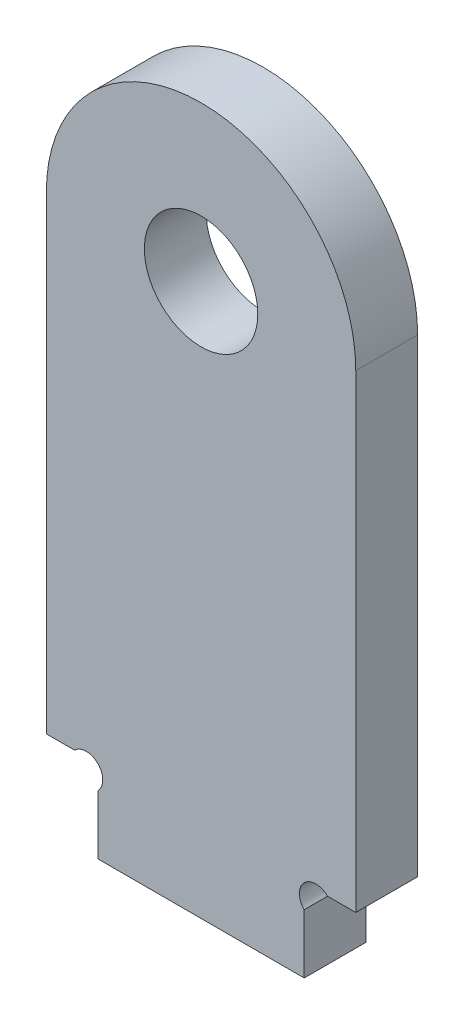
ISO-10303-21;
HEADER;
FILE_DESCRIPTION(('STEP AP214'),'2;1');
FILE_NAME('part.step','',(''),(''),'','','');
FILE_SCHEMA(('AUTOMOTIVE_DESIGN { 1 0 10303 214 1 1 1 1 }'));
ENDSEC;
DATA;
#1=APPLICATION_CONTEXT('core data for automotive mechanical design processes');
#2=APPLICATION_PROTOCOL_DEFINITION('international standard','automotive_design',2000,#1);
#3=PRODUCT_CONTEXT('',#1,'mechanical');
#4=PRODUCT('Part','Part','',(#3));
#5=PRODUCT_RELATED_PRODUCT_CATEGORY('part','',(#4));
#6=PRODUCT_DEFINITION_FORMATION('','',#4);
#7=PRODUCT_DEFINITION_CONTEXT('part definition',#1,'design');
#8=PRODUCT_DEFINITION('design','',#6,#7);
#9=PRODUCT_DEFINITION_SHAPE('','',#8);
#10=(LENGTH_UNIT() NAMED_UNIT(*) SI_UNIT(.MILLI.,.METRE.));
#11=(NAMED_UNIT(*) PLANE_ANGLE_UNIT() SI_UNIT($,.RADIAN.));
#12=(NAMED_UNIT(*) SI_UNIT($,.STERADIAN.) SOLID_ANGLE_UNIT());
#13=UNCERTAINTY_MEASURE_WITH_UNIT(LENGTH_MEASURE(1.E-05),#10,'distance_accuracy_value','');
#14=(GEOMETRIC_REPRESENTATION_CONTEXT(3) GLOBAL_UNCERTAINTY_ASSIGNED_CONTEXT((#13)) GLOBAL_UNIT_ASSIGNED_CONTEXT((#10,
#11,#12)) REPRESENTATION_CONTEXT('',''));
#15=CARTESIAN_POINT('',(0.,0.,0.));
#16=DIRECTION('',(0.,0.,1.));
#17=DIRECTION('',(1.,0.,0.));
#18=AXIS2_PLACEMENT_3D('',#15,#16,#17);
#19=CARTESIAN_POINT('',(15.,45.5,6.));
#20=DIRECTION('',(0.,0.,-1.));
#21=DIRECTION('',(-1.,0.,0.));
#22=AXIS2_PLACEMENT_3D('',#19,#20,#21);
#23=PLANE('',#22);
#24=CARTESIAN_POINT('',(15.,45.5,6.));
#25=DIRECTION('',(0.,0.,1.));
#26=DIRECTION('',(-1.,0.,0.));
#27=AXIS2_PLACEMENT_3D('',#24,#25,#26);
#28=CIRCLE('',#27,15.);
#29=CARTESIAN_POINT('',(30.,45.5,6.));
#30=VERTEX_POINT('',#29);
#31=CARTESIAN_POINT('',(0.,45.5,6.));
#32=VERTEX_POINT('',#31);
#33=EDGE_CURVE('E144',#30,#32,#28,.T.);
#34=ORIENTED_EDGE('',*,*,#33,.T.);
#35=DIRECTION('',(0.,-1.,0.));
#36=VECTOR('',#35,1.);
#37=CARTESIAN_POINT('',(0.,45.5,6.));
#38=LINE('',#37,#36);
#39=CARTESIAN_POINT('',(0.,0.,6.));
#40=VERTEX_POINT('',#39);
#41=EDGE_CURVE('E117',#32,#40,#38,.T.);
#42=ORIENTED_EDGE('',*,*,#41,.T.);
#43=DIRECTION('',(1.,0.,0.));
#44=VECTOR('',#43,1.);
#45=CARTESIAN_POINT('',(0.,0.,6.));
#46=LINE('',#45,#44);
#47=CARTESIAN_POINT('',(2.73725830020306,0.,6.));
#48=VERTEX_POINT('',#47);
#49=EDGE_CURVE('E147',#40,#48,#46,.T.);
#50=ORIENTED_EDGE('',*,*,#49,.T.);
#51=CARTESIAN_POINT('',(3.86862915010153,-1.13137084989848,6.));
#52=DIRECTION('',(0.,0.,-1.));
#53=DIRECTION('',(1.,0.,0.));
#54=AXIS2_PLACEMENT_3D('',#51,#52,#53);
#55=CIRCLE('',#54,1.6);
#56=CARTESIAN_POINT('',(5.,-2.26274169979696,6.));
#57=VERTEX_POINT('',#56);
#58=EDGE_CURVE('E149',#48,#57,#55,.T.);
#59=ORIENTED_EDGE('',*,*,#58,.T.);
#60=DIRECTION('',(0.,-1.,0.));
#61=VECTOR('',#60,1.);
#62=CARTESIAN_POINT('',(5.,-2.26274169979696,6.));
#63=LINE('',#62,#61);
#64=CARTESIAN_POINT('',(5.,-8.,6.));
#65=VERTEX_POINT('',#64);
#66=EDGE_CURVE('E151',#57,#65,#63,.T.);
#67=ORIENTED_EDGE('',*,*,#66,.T.);
#68=DIRECTION('',(1.,0.,0.));
#69=VECTOR('',#68,1.);
#70=CARTESIAN_POINT('',(5.,-8.,6.));
#71=LINE('',#70,#69);
#72=CARTESIAN_POINT('',(25.,-8.,6.));
#73=VERTEX_POINT('',#72);
#74=EDGE_CURVE('E153',#65,#73,#71,.T.);
#75=ORIENTED_EDGE('',*,*,#74,.T.);
#76=DIRECTION('',(0.,1.,0.));
#77=VECTOR('',#76,1.);
#78=CARTESIAN_POINT('',(25.,-8.,6.));
#79=LINE('',#78,#77);
#80=CARTESIAN_POINT('',(25.,-2.26274169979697,6.));
#81=VERTEX_POINT('',#80);
#82=EDGE_CURVE('E155',#73,#81,#79,.T.);
#83=ORIENTED_EDGE('',*,*,#82,.T.);
#84=CARTESIAN_POINT('',(26.1313708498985,-1.13137084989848,6.));
#85=DIRECTION('',(0.,0.,-1.));
#86=DIRECTION('',(-1.,0.,0.));
#87=AXIS2_PLACEMENT_3D('',#84,#85,#86);
#88=CIRCLE('',#87,1.6);
#89=CARTESIAN_POINT('',(27.262741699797,0.,6.));
#90=VERTEX_POINT('',#89);
#91=EDGE_CURVE('E157',#81,#90,#88,.T.);
#92=ORIENTED_EDGE('',*,*,#91,.T.);
#93=DIRECTION('',(1.,0.,0.));
#94=VECTOR('',#93,1.);
#95=CARTESIAN_POINT('',(27.262741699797,0.,6.));
#96=LINE('',#95,#94);
#97=CARTESIAN_POINT('',(30.,0.,6.));
#98=VERTEX_POINT('',#97);
#99=EDGE_CURVE('E46',#90,#98,#96,.T.);
#100=ORIENTED_EDGE('',*,*,#99,.T.);
#101=DIRECTION('',(0.,1.,0.));
#102=VECTOR('',#101,1.);
#103=CARTESIAN_POINT('',(30.,0.,6.));
#104=LINE('',#103,#102);
#105=EDGE_CURVE('E41',#98,#30,#104,.T.);
#106=ORIENTED_EDGE('',*,*,#105,.T.);
#107=EDGE_LOOP('',(#34,#42,#50,#59,#67,#75,#83,#92,#100,#106));
#108=FACE_BOUND('',#107,.T.);
#109=CARTESIAN_POINT('',(15.,45.5,6.));
#110=DIRECTION('',(0.,0.,1.));
#111=DIRECTION('',(1.,0.,0.));
#112=AXIS2_PLACEMENT_3D('',#109,#110,#111);
#113=CIRCLE('',#112,5.5);
#114=CARTESIAN_POINT('',(20.5,45.5,6.));
#115=VERTEX_POINT('',#114);
#116=EDGE_CURVE('E122',#115,#115,#113,.T.);
#117=ORIENTED_EDGE('',*,*,#116,.F.);
#118=EDGE_LOOP('',(#117));
#119=FACE_BOUND('',#118,.T.);
#120=ADVANCED_FACE('F26',(#108,#119),#23,.F.);
#121=CARTESIAN_POINT('',(15.,45.5,0.));
#122=DIRECTION('',(0.,0.,-1.));
#123=DIRECTION('',(-1.,0.,0.));
#124=AXIS2_PLACEMENT_3D('',#121,#122,#123);
#125=PLANE('',#124);
#126=CARTESIAN_POINT('',(15.,45.5,0.));
#127=DIRECTION('',(0.,0.,1.));
#128=DIRECTION('',(-1.,0.,0.));
#129=AXIS2_PLACEMENT_3D('',#126,#127,#128);
#130=CIRCLE('',#129,15.);
#131=CARTESIAN_POINT('',(30.,45.5,0.));
#132=VERTEX_POINT('',#131);
#133=CARTESIAN_POINT('',(0.,45.5,0.));
#134=VERTEX_POINT('',#133);
#135=EDGE_CURVE('E108',#132,#134,#130,.T.);
#136=ORIENTED_EDGE('',*,*,#135,.F.);
#137=DIRECTION('',(0.,1.,0.));
#138=VECTOR('',#137,1.);
#139=CARTESIAN_POINT('',(30.,0.,0.));
#140=LINE('',#139,#138);
#141=CARTESIAN_POINT('',(30.,0.,0.));
#142=VERTEX_POINT('',#141);
#143=EDGE_CURVE('E142',#142,#132,#140,.T.);
#144=ORIENTED_EDGE('',*,*,#143,.F.);
#145=DIRECTION('',(1.,0.,0.));
#146=VECTOR('',#145,1.);
#147=CARTESIAN_POINT('',(27.262741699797,0.,0.));
#148=LINE('',#147,#146);
#149=CARTESIAN_POINT('',(27.262741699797,0.,0.));
#150=VERTEX_POINT('',#149);
#151=EDGE_CURVE('E140',#150,#142,#148,.T.);
#152=ORIENTED_EDGE('',*,*,#151,.F.);
#153=CARTESIAN_POINT('',(26.1313708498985,-1.13137084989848,0.));
#154=DIRECTION('',(0.,0.,-1.));
#155=DIRECTION('',(-1.,0.,0.));
#156=AXIS2_PLACEMENT_3D('',#153,#154,#155);
#157=CIRCLE('',#156,1.6);
#158=CARTESIAN_POINT('',(25.,-2.26274169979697,0.));
#159=VERTEX_POINT('',#158);
#160=EDGE_CURVE('E138',#159,#150,#157,.T.);
#161=ORIENTED_EDGE('',*,*,#160,.F.);
#162=DIRECTION('',(0.,1.,0.));
#163=VECTOR('',#162,1.);
#164=CARTESIAN_POINT('',(25.,-8.,0.));
#165=LINE('',#164,#163);
#166=CARTESIAN_POINT('',(25.,-8.,0.));
#167=VERTEX_POINT('',#166);
#168=EDGE_CURVE('E136',#167,#159,#165,.T.);
#169=ORIENTED_EDGE('',*,*,#168,.F.);
#170=DIRECTION('',(1.,0.,0.));
#171=VECTOR('',#170,1.);
#172=CARTESIAN_POINT('',(5.,-8.,0.));
#173=LINE('',#172,#171);
#174=CARTESIAN_POINT('',(5.,-8.,0.));
#175=VERTEX_POINT('',#174);
#176=EDGE_CURVE('E134',#175,#167,#173,.T.);
#177=ORIENTED_EDGE('',*,*,#176,.F.);
#178=DIRECTION('',(0.,-1.,0.));
#179=VECTOR('',#178,1.);
#180=CARTESIAN_POINT('',(5.,-2.26274169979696,0.));
#181=LINE('',#180,#179);
#182=CARTESIAN_POINT('',(5.,-2.26274169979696,0.));
#183=VERTEX_POINT('',#182);
#184=EDGE_CURVE('E132',#183,#175,#181,.T.);
#185=ORIENTED_EDGE('',*,*,#184,.F.);
#186=CARTESIAN_POINT('',(3.86862915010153,-1.13137084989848,0.));
#187=DIRECTION('',(0.,0.,-1.));
#188=DIRECTION('',(1.,0.,0.));
#189=AXIS2_PLACEMENT_3D('',#186,#187,#188);
#190=CIRCLE('',#189,1.6);
#191=CARTESIAN_POINT('',(2.73725830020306,0.,0.));
#192=VERTEX_POINT('',#191);
#193=EDGE_CURVE('E130',#192,#183,#190,.T.);
#194=ORIENTED_EDGE('',*,*,#193,.F.);
#195=DIRECTION('',(1.,0.,0.));
#196=VECTOR('',#195,1.);
#197=CARTESIAN_POINT('',(0.,0.,0.));
#198=LINE('',#197,#196);
#199=CARTESIAN_POINT('',(0.,0.,0.));
#200=VERTEX_POINT('',#199);
#201=EDGE_CURVE('E110',#200,#192,#198,.T.);
#202=ORIENTED_EDGE('',*,*,#201,.F.);
#203=DIRECTION('',(0.,-1.,0.));
#204=VECTOR('',#203,1.);
#205=CARTESIAN_POINT('',(0.,45.5,0.));
#206=LINE('',#205,#204);
#207=EDGE_CURVE('E103',#134,#200,#206,.T.);
#208=ORIENTED_EDGE('',*,*,#207,.F.);
#209=EDGE_LOOP('',(#136,#144,#152,#161,#169,#177,#185,#194,#202,#208));
#210=FACE_BOUND('',#209,.T.);
#211=CARTESIAN_POINT('',(15.,45.5,0.));
#212=DIRECTION('',(0.,0.,1.));
#213=DIRECTION('',(1.,0.,0.));
#214=AXIS2_PLACEMENT_3D('',#211,#212,#213);
#215=CIRCLE('',#214,5.5);
#216=CARTESIAN_POINT('',(20.5,45.5,0.));
#217=VERTEX_POINT('',#216);
#218=EDGE_CURVE('E125',#217,#217,#215,.T.);
#219=ORIENTED_EDGE('',*,*,#218,.T.);
#220=EDGE_LOOP('',(#219));
#221=FACE_BOUND('',#220,.T.);
#222=ADVANCED_FACE('F104',(#210,#221),#125,.T.);
#223=CARTESIAN_POINT('',(15.,45.5,6.));
#224=DIRECTION('',(0.,0.,-1.));
#225=DIRECTION('',(-1.,0.,0.));
#226=AXIS2_PLACEMENT_3D('',#223,#224,#225);
#227=CYLINDRICAL_SURFACE('',#226,15.);
#228=ORIENTED_EDGE('',*,*,#135,.T.);
#229=DIRECTION('',(0.,0.,-1.));
#230=VECTOR('',#229,1.);
#231=CARTESIAN_POINT('',(0.,45.5,6.));
#232=LINE('',#231,#230);
#233=EDGE_CURVE('E11',#32,#134,#232,.T.);
#234=ORIENTED_EDGE('',*,*,#233,.F.);
#235=ORIENTED_EDGE('',*,*,#33,.F.);
#236=DIRECTION('',(0.,0.,-1.));
#237=VECTOR('',#236,1.);
#238=CARTESIAN_POINT('',(30.,45.5,6.));
#239=LINE('',#238,#237);
#240=EDGE_CURVE('E121',#30,#132,#239,.T.);
#241=ORIENTED_EDGE('',*,*,#240,.T.);
#242=EDGE_LOOP('',(#228,#234,#235,#241));
#243=FACE_BOUND('',#242,.T.);
#244=ADVANCED_FACE('F28',(#243),#227,.T.);
#245=CARTESIAN_POINT('',(0.,45.5,6.));
#246=DIRECTION('',(1.,0.,0.));
#247=DIRECTION('',(0.,0.,-1.));
#248=AXIS2_PLACEMENT_3D('',#245,#246,#247);
#249=PLANE('',#248);
#250=ORIENTED_EDGE('',*,*,#207,.T.);
#251=DIRECTION('',(0.,0.,-1.));
#252=VECTOR('',#251,1.);
#253=CARTESIAN_POINT('',(0.,0.,6.));
#254=LINE('',#253,#252);
#255=EDGE_CURVE('E34',#40,#200,#254,.T.);
#256=ORIENTED_EDGE('',*,*,#255,.F.);
#257=ORIENTED_EDGE('',*,*,#41,.F.);
#258=ORIENTED_EDGE('',*,*,#233,.T.);
#259=EDGE_LOOP('',(#250,#256,#257,#258));
#260=FACE_BOUND('',#259,.T.);
#261=ADVANCED_FACE('F116',(#260),#249,.F.);
#262=CARTESIAN_POINT('',(0.,0.,6.));
#263=DIRECTION('',(0.,1.,0.));
#264=DIRECTION('',(0.,0.,1.));
#265=AXIS2_PLACEMENT_3D('',#262,#263,#264);
#266=PLANE('',#265);
#267=ORIENTED_EDGE('',*,*,#201,.T.);
#268=DIRECTION('',(0.,0.,-1.));
#269=VECTOR('',#268,1.);
#270=CARTESIAN_POINT('',(2.73725830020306,0.,6.));
#271=LINE('',#270,#269);
#272=EDGE_CURVE('E180',#48,#192,#271,.T.);
#273=ORIENTED_EDGE('',*,*,#272,.F.);
#274=ORIENTED_EDGE('',*,*,#49,.F.);
#275=ORIENTED_EDGE('',*,*,#255,.T.);
#276=EDGE_LOOP('',(#267,#273,#274,#275));
#277=FACE_BOUND('',#276,.T.);
#278=ADVANCED_FACE('F184',(#277),#266,.F.);
#279=CARTESIAN_POINT('',(3.86862915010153,-1.13137084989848,6.));
#280=DIRECTION('',(0.,0.,-1.));
#281=DIRECTION('',(-1.,0.,0.));
#282=AXIS2_PLACEMENT_3D('',#279,#280,#281);
#283=CYLINDRICAL_SURFACE('',#282,1.6);
#284=ORIENTED_EDGE('',*,*,#193,.T.);
#285=DIRECTION('',(0.,0.,-1.));
#286=VECTOR('',#285,1.);
#287=CARTESIAN_POINT('',(5.,-2.26274169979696,6.));
#288=LINE('',#287,#286);
#289=EDGE_CURVE('E177',#57,#183,#288,.T.);
#290=ORIENTED_EDGE('',*,*,#289,.F.);
#291=ORIENTED_EDGE('',*,*,#58,.F.);
#292=ORIENTED_EDGE('',*,*,#272,.T.);
#293=EDGE_LOOP('',(#284,#290,#291,#292));
#294=FACE_BOUND('',#293,.T.);
#295=ADVANCED_FACE('F192',(#294),#283,.F.);
#296=CARTESIAN_POINT('',(5.,-2.26274169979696,6.));
#297=DIRECTION('',(1.,0.,0.));
#298=DIRECTION('',(0.,1.,0.));
#299=AXIS2_PLACEMENT_3D('',#296,#297,#298);
#300=PLANE('',#299);
#301=ORIENTED_EDGE('',*,*,#184,.T.);
#302=DIRECTION('',(0.,0.,-1.));
#303=VECTOR('',#302,1.);
#304=CARTESIAN_POINT('',(5.,-8.,6.));
#305=LINE('',#304,#303);
#306=EDGE_CURVE('E174',#65,#175,#305,.T.);
#307=ORIENTED_EDGE('',*,*,#306,.F.);
#308=ORIENTED_EDGE('',*,*,#66,.F.);
#309=ORIENTED_EDGE('',*,*,#289,.T.);
#310=EDGE_LOOP('',(#301,#307,#308,#309));
#311=FACE_BOUND('',#310,.T.);
#312=ADVANCED_FACE('F195',(#311),#300,.F.);
#313=CARTESIAN_POINT('',(5.,-8.,6.));
#314=DIRECTION('',(0.,1.,0.));
#315=DIRECTION('',(0.,0.,1.));
#316=AXIS2_PLACEMENT_3D('',#313,#314,#315);
#317=PLANE('',#316);
#318=ORIENTED_EDGE('',*,*,#176,.T.);
#319=DIRECTION('',(0.,0.,-1.));
#320=VECTOR('',#319,1.);
#321=CARTESIAN_POINT('',(25.,-8.,6.));
#322=LINE('',#321,#320);
#323=EDGE_CURVE('E171',#73,#167,#322,.T.);
#324=ORIENTED_EDGE('',*,*,#323,.F.);
#325=ORIENTED_EDGE('',*,*,#74,.F.);
#326=ORIENTED_EDGE('',*,*,#306,.T.);
#327=EDGE_LOOP('',(#318,#324,#325,#326));
#328=FACE_BOUND('',#327,.T.);
#329=ADVANCED_FACE('F200',(#328),#317,.F.);
#330=CARTESIAN_POINT('',(25.,-8.,6.));
#331=DIRECTION('',(-1.,0.,0.));
#332=DIRECTION('',(0.,0.,1.));
#333=AXIS2_PLACEMENT_3D('',#330,#331,#332);
#334=PLANE('',#333);
#335=ORIENTED_EDGE('',*,*,#168,.T.);
#336=DIRECTION('',(0.,0.,-1.));
#337=VECTOR('',#336,1.);
#338=CARTESIAN_POINT('',(25.,-2.26274169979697,6.));
#339=LINE('',#338,#337);
#340=EDGE_CURVE('E168',#81,#159,#339,.T.);
#341=ORIENTED_EDGE('',*,*,#340,.F.);
#342=ORIENTED_EDGE('',*,*,#82,.F.);
#343=ORIENTED_EDGE('',*,*,#323,.T.);
#344=EDGE_LOOP('',(#335,#341,#342,#343));
#345=FACE_BOUND('',#344,.T.);
#346=ADVANCED_FACE('F206',(#345),#334,.F.);
#347=CARTESIAN_POINT('',(26.1313708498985,-1.13137084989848,6.));
#348=DIRECTION('',(0.,0.,-1.));
#349=DIRECTION('',(-1.,0.,0.));
#350=AXIS2_PLACEMENT_3D('',#347,#348,#349);
#351=CYLINDRICAL_SURFACE('',#350,1.6);
#352=ORIENTED_EDGE('',*,*,#160,.T.);
#353=DIRECTION('',(0.,0.,-1.));
#354=VECTOR('',#353,1.);
#355=CARTESIAN_POINT('',(27.262741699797,0.,6.));
#356=LINE('',#355,#354);
#357=EDGE_CURVE('E165',#90,#150,#356,.T.);
#358=ORIENTED_EDGE('',*,*,#357,.F.);
#359=ORIENTED_EDGE('',*,*,#91,.F.);
#360=ORIENTED_EDGE('',*,*,#340,.T.);
#361=EDGE_LOOP('',(#352,#358,#359,#360));
#362=FACE_BOUND('',#361,.T.);
#363=ADVANCED_FACE('F210',(#362),#351,.F.);
#364=CARTESIAN_POINT('',(27.262741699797,0.,6.));
#365=DIRECTION('',(0.,1.,0.));
#366=DIRECTION('',(-1.,0.,0.));
#367=AXIS2_PLACEMENT_3D('',#364,#365,#366);
#368=PLANE('',#367);
#369=ORIENTED_EDGE('',*,*,#151,.T.);
#370=DIRECTION('',(0.,0.,-1.));
#371=VECTOR('',#370,1.);
#372=CARTESIAN_POINT('',(30.,0.,6.));
#373=LINE('',#372,#371);
#374=EDGE_CURVE('E162',#98,#142,#373,.T.);
#375=ORIENTED_EDGE('',*,*,#374,.F.);
#376=ORIENTED_EDGE('',*,*,#99,.F.);
#377=ORIENTED_EDGE('',*,*,#357,.T.);
#378=EDGE_LOOP('',(#369,#375,#376,#377));
#379=FACE_BOUND('',#378,.T.);
#380=ADVANCED_FACE('F213',(#379),#368,.F.);
#381=CARTESIAN_POINT('',(30.,0.,6.));
#382=DIRECTION('',(-1.,0.,0.));
#383=DIRECTION('',(0.,-1.,0.));
#384=AXIS2_PLACEMENT_3D('',#381,#382,#383);
#385=PLANE('',#384);
#386=ORIENTED_EDGE('',*,*,#143,.T.);
#387=ORIENTED_EDGE('',*,*,#240,.F.);
#388=ORIENTED_EDGE('',*,*,#105,.F.);
#389=ORIENTED_EDGE('',*,*,#374,.T.);
#390=EDGE_LOOP('',(#386,#387,#388,#389));
#391=FACE_BOUND('',#390,.T.);
#392=ADVANCED_FACE('F215',(#391),#385,.F.);
#393=CARTESIAN_POINT('',(15.,45.5,6.));
#394=DIRECTION('',(0.,0.,-1.));
#395=DIRECTION('',(-1.,0.,0.));
#396=AXIS2_PLACEMENT_3D('',#393,#394,#395);
#397=CYLINDRICAL_SURFACE('',#396,5.5);
#398=ORIENTED_EDGE('',*,*,#116,.T.);
#399=EDGE_LOOP('',(#398));
#400=FACE_BOUND('',#399,.T.);
#401=ORIENTED_EDGE('',*,*,#218,.F.);
#402=EDGE_LOOP('',(#401));
#403=FACE_BOUND('',#402,.T.);
#404=ADVANCED_FACE('F217',(#400,#403),#397,.F.);
#405=CLOSED_SHELL('',(#120,#222,#244,#261,#278,#295,#312,#329,#346,#363,#380,#392,#404));
#406=MANIFOLD_SOLID_BREP('B2',#405);
#407=ADVANCED_BREP_SHAPE_REPRESENTATION('',(#18,#406),#14);
#408=SHAPE_DEFINITION_REPRESENTATION(#9,#407);
ENDSEC;
END-ISO-10303-21;
